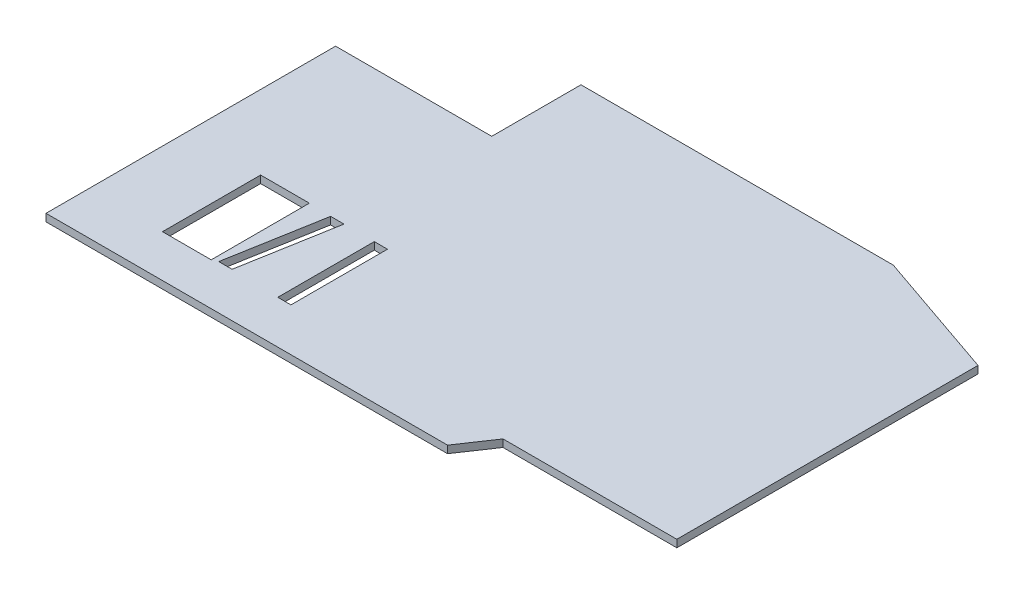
ISO-10303-21;
HEADER;
FILE_DESCRIPTION(('STEP AP214'),'2;1');
FILE_NAME('part.step','',(''),(''),'','','');
FILE_SCHEMA(('AUTOMOTIVE_DESIGN { 1 0 10303 214 1 1 1 1 }'));
ENDSEC;
DATA;
#1=APPLICATION_CONTEXT('core data for automotive mechanical design processes');
#2=APPLICATION_PROTOCOL_DEFINITION('international standard','automotive_design',2000,#1);
#3=PRODUCT_CONTEXT('',#1,'mechanical');
#4=PRODUCT('Part','Part','',(#3));
#5=PRODUCT_RELATED_PRODUCT_CATEGORY('part','',(#4));
#6=PRODUCT_DEFINITION_FORMATION('','',#4);
#7=PRODUCT_DEFINITION_CONTEXT('part definition',#1,'design');
#8=PRODUCT_DEFINITION('design','',#6,#7);
#9=PRODUCT_DEFINITION_SHAPE('','',#8);
#10=(LENGTH_UNIT() NAMED_UNIT(*) SI_UNIT(.MILLI.,.METRE.));
#11=(NAMED_UNIT(*) PLANE_ANGLE_UNIT() SI_UNIT($,.RADIAN.));
#12=(NAMED_UNIT(*) SI_UNIT($,.STERADIAN.) SOLID_ANGLE_UNIT());
#13=UNCERTAINTY_MEASURE_WITH_UNIT(LENGTH_MEASURE(1.E-05),#10,'distance_accuracy_value','');
#14=(GEOMETRIC_REPRESENTATION_CONTEXT(3) GLOBAL_UNCERTAINTY_ASSIGNED_CONTEXT((#13)) GLOBAL_UNIT_ASSIGNED_CONTEXT((#10,
#11,#12)) REPRESENTATION_CONTEXT('',''));
#15=CARTESIAN_POINT('',(0.,0.,0.));
#16=DIRECTION('',(0.,0.,1.));
#17=DIRECTION('',(1.,0.,0.));
#18=AXIS2_PLACEMENT_3D('',#15,#16,#17);
#19=CARTESIAN_POINT('',(2435.961,101.6,0.));
#20=DIRECTION('',(0.,1.,0.));
#21=DIRECTION('',(0.,0.,1.));
#22=AXIS2_PLACEMENT_3D('',#19,#20,#21);
#23=PLANE('',#22);
#24=DIRECTION('',(0.999999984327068,0.,0.000177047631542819));
#25=VECTOR('',#24,1.);
#26=CARTESIAN_POINT('',(1933.85026050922,101.6,-608.859114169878));
#27=LINE('',#26,#25);
#28=CARTESIAN_POINT('',(1751.24445826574,101.6,-608.891444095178));
#29=VERTEX_POINT('',#28);
#30=CARTESIAN_POINT('',(1933.85026050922,101.6,-608.859114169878));
#31=VERTEX_POINT('',#30);
#32=EDGE_CURVE('E56',#29,#31,#27,.T.);
#33=ORIENTED_EDGE('',*,*,#32,.F.);
#34=DIRECTION('',(-0.173810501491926,0.,0.984779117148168));
#35=VECTOR('',#34,1.);
#36=CARTESIAN_POINT('',(1751.24445826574,101.6,-608.891444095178));
#37=LINE('',#36,#35);
#38=CARTESIAN_POINT('',(1980.56363727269,101.6,-1908.17276892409));
#39=VERTEX_POINT('',#38);
#40=EDGE_CURVE('E209',#39,#29,#37,.T.);
#41=ORIENTED_EDGE('',*,*,#40,.F.);
#42=DIRECTION('',(-0.999999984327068,0.,-0.000177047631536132));
#43=VECTOR('',#42,1.);
#44=CARTESIAN_POINT('',(2163.16943951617,101.6,-1908.14043899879));
#45=LINE('',#44,#43);
#46=CARTESIAN_POINT('',(2163.16943951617,101.6,-1908.14043899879));
#47=VERTEX_POINT('',#46);
#48=EDGE_CURVE('E212',#47,#39,#45,.T.);
#49=ORIENTED_EDGE('',*,*,#48,.F.);
#50=DIRECTION('',(0.173810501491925,0.,-0.984779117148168));
#51=VECTOR('',#50,1.);
#52=CARTESIAN_POINT('',(1933.85026050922,101.6,-608.859114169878));
#53=LINE('',#52,#51);
#54=EDGE_CURVE('E219',#31,#47,#53,.T.);
#55=ORIENTED_EDGE('',*,*,#54,.F.);
#56=EDGE_LOOP('',(#33,#41,#49,#55));
#57=FACE_BOUND('',#56,.T.);
#58=DIRECTION('',(0.999999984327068,0.,0.000177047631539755));
#59=VECTOR('',#58,1.);
#60=CARTESIAN_POINT('',(2757.17381212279,101.6,-589.612691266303));
#61=LINE('',#60,#59);
#62=CARTESIAN_POINT('',(2577.34181494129,101.6,-589.644530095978));
#63=VERTEX_POINT('',#62);
#64=CARTESIAN_POINT('',(2757.17381212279,101.6,-589.612691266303));
#65=VERTEX_POINT('',#64);
#66=EDGE_CURVE('E227',#63,#65,#61,.T.);
#67=ORIENTED_EDGE('',*,*,#66,.F.);
#68=DIRECTION('',(-0.000177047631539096,0.,0.999999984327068));
#69=VECTOR('',#68,1.);
#70=CARTESIAN_POINT('',(2577.34181494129,101.6,-589.644530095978));
#71=LINE('',#70,#69);
#72=CARTESIAN_POINT('',(2577.57523853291,101.6,-1908.06706943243));
#73=VERTEX_POINT('',#72);
#74=EDGE_CURVE('E236',#73,#63,#71,.T.);
#75=ORIENTED_EDGE('',*,*,#74,.F.);
#76=DIRECTION('',(-0.999999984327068,0.,-0.000177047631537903));
#77=VECTOR('',#76,1.);
#78=CARTESIAN_POINT('',(2757.40723571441,101.6,-1908.03523060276));
#79=LINE('',#78,#77);
#80=CARTESIAN_POINT('',(2757.40723571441,101.6,-1908.03523060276));
#81=VERTEX_POINT('',#80);
#82=EDGE_CURVE('E254',#81,#73,#79,.T.);
#83=ORIENTED_EDGE('',*,*,#82,.F.);
#84=DIRECTION('',(0.000177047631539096,0.,-0.999999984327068));
#85=VECTOR('',#84,1.);
#86=CARTESIAN_POINT('',(2757.17381212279,101.6,-589.612691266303));
#87=LINE('',#86,#85);
#88=EDGE_CURVE('E250',#65,#81,#87,.T.);
#89=ORIENTED_EDGE('',*,*,#88,.F.);
#90=EDGE_LOOP('',(#67,#75,#83,#89));
#91=FACE_BOUND('',#90,.T.);
#92=DIRECTION('',(-1.,0.,0.));
#93=VECTOR('',#92,1.);
#94=CARTESIAN_POINT('',(1013.37500000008,101.6,-1919.06250000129));
#95=LINE('',#94,#93);
#96=CARTESIAN_POINT('',(1679.17500000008,101.6,-1919.06250000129));
#97=VERTEX_POINT('',#96);
#98=CARTESIAN_POINT('',(1013.37500000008,101.6,-1919.06250000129));
#99=VERTEX_POINT('',#98);
#100=EDGE_CURVE('E263',#97,#99,#95,.T.);
#101=ORIENTED_EDGE('',*,*,#100,.F.);
#102=DIRECTION('',(0.,0.,-1.));
#103=VECTOR('',#102,1.);
#104=CARTESIAN_POINT('',(1679.17500000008,101.6,-1919.06250000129));
#105=LINE('',#104,#103);
#106=CARTESIAN_POINT('',(1679.17500000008,101.6,-578.262500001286));
#107=VERTEX_POINT('',#106);
#108=EDGE_CURVE('E276',#107,#97,#105,.T.);
#109=ORIENTED_EDGE('',*,*,#108,.F.);
#110=DIRECTION('',(1.,0.,0.));
#111=VECTOR('',#110,1.);
#112=CARTESIAN_POINT('',(1013.37500000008,101.6,-578.262500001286));
#113=LINE('',#112,#111);
#114=CARTESIAN_POINT('',(1013.37500000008,101.6,-578.262500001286));
#115=VERTEX_POINT('',#114);
#116=EDGE_CURVE('E291',#115,#107,#113,.T.);
#117=ORIENTED_EDGE('',*,*,#116,.F.);
#118=DIRECTION('',(0.,0.,1.));
#119=VECTOR('',#118,1.);
#120=CARTESIAN_POINT('',(1013.37500000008,101.6,-578.262500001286));
#121=LINE('',#120,#119);
#122=EDGE_CURVE('E288',#99,#115,#121,.T.);
#123=ORIENTED_EDGE('',*,*,#122,.F.);
#124=EDGE_LOOP('',(#101,#109,#117,#123));
#125=FACE_BOUND('',#124,.T.);
#126=DIRECTION('',(0.000173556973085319,0.,-0.999999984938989));
#127=VECTOR('',#126,1.);
#128=CARTESIAN_POINT('',(0.686615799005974,101.6,-3956.14060592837));
#129=LINE('',#128,#127);
#130=CARTESIAN_POINT('',(0.,101.6,0.));
#131=VERTEX_POINT('',#130);
#132=CARTESIAN_POINT('',(0.686615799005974,101.6,-3956.14060592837));
#133=VERTEX_POINT('',#132);
#134=EDGE_CURVE('E11',#131,#133,#129,.T.);
#135=ORIENTED_EDGE('',*,*,#134,.F.);
#136=DIRECTION('',(-1.,0.,0.));
#137=VECTOR('',#136,1.);
#138=CARTESIAN_POINT('',(0.,101.6,0.));
#139=LINE('',#138,#137);
#140=CARTESIAN_POINT('',(5486.4,101.6,0.));
#141=VERTEX_POINT('',#140);
#142=EDGE_CURVE('E311',#141,#131,#139,.T.);
#143=ORIENTED_EDGE('',*,*,#142,.F.);
#144=DIRECTION('',(0.559192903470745,0.,-0.829037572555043));
#145=VECTOR('',#144,1.);
#146=CARTESIAN_POINT('',(5791.77524458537,101.6,-452.737418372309));
#147=LINE('',#146,#145);
#148=CARTESIAN_POINT('',(5791.77524458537,101.6,-452.737418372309));
#149=VERTEX_POINT('',#148);
#150=EDGE_CURVE('E345',#141,#149,#147,.T.);
#151=ORIENTED_EDGE('',*,*,#150,.T.);
#152=DIRECTION('',(1.,0.,0.));
#153=VECTOR('',#152,1.);
#154=CARTESIAN_POINT('',(8166.67524458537,101.6,-452.737418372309));
#155=LINE('',#154,#153);
#156=CARTESIAN_POINT('',(8166.67524458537,101.6,-452.737418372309));
#157=VERTEX_POINT('',#156);
#158=EDGE_CURVE('E349',#149,#157,#155,.T.);
#159=ORIENTED_EDGE('',*,*,#158,.T.);
#160=DIRECTION('',(0.,0.,1.));
#161=VECTOR('',#160,1.);
#162=CARTESIAN_POINT('',(8166.67524458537,101.6,-452.737418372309));
#163=LINE('',#162,#161);
#164=CARTESIAN_POINT('',(8166.67524458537,101.6,-4567.53741837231));
#165=VERTEX_POINT('',#164);
#166=EDGE_CURVE('E314',#165,#157,#163,.T.);
#167=ORIENTED_EDGE('',*,*,#166,.F.);
#168=DIRECTION('',(-0.945518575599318,0.,-0.325568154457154));
#169=VECTOR('',#168,1.);
#170=CARTESIAN_POINT('',(6401.48661579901,101.6,-5175.34060592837));
#171=LINE('',#170,#169);
#172=CARTESIAN_POINT('',(6401.48661579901,101.6,-5175.34060592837));
#173=VERTEX_POINT('',#172);
#174=EDGE_CURVE('E352',#165,#173,#171,.T.);
#175=ORIENTED_EDGE('',*,*,#174,.T.);
#176=DIRECTION('',(1.,0.,0.));
#177=VECTOR('',#176,1.);
#178=CARTESIAN_POINT('',(6401.48661579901,101.6,-5175.34060592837));
#179=LINE('',#178,#177);
#180=CARTESIAN_POINT('',(2134.28661579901,101.6,-5175.34060592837));
#181=VERTEX_POINT('',#180);
#182=EDGE_CURVE('E48',#181,#173,#179,.T.);
#183=ORIENTED_EDGE('',*,*,#182,.F.);
#184=DIRECTION('',(0.,0.,1.));
#185=VECTOR('',#184,1.);
#186=CARTESIAN_POINT('',(2134.28661579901,101.6,-3956.14060592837));
#187=LINE('',#186,#185);
#188=CARTESIAN_POINT('',(2134.28661579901,101.6,-3956.14060592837));
#189=VERTEX_POINT('',#188);
#190=EDGE_CURVE('E355',#181,#189,#187,.T.);
#191=ORIENTED_EDGE('',*,*,#190,.T.);
#192=DIRECTION('',(-1.,0.,0.));
#193=VECTOR('',#192,1.);
#194=CARTESIAN_POINT('',(0.686615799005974,101.6,-3956.14060592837));
#195=LINE('',#194,#193);
#196=EDGE_CURVE('E298',#189,#133,#195,.T.);
#197=ORIENTED_EDGE('',*,*,#196,.T.);
#198=EDGE_LOOP('',(#135,#143,#151,#159,#167,#175,#183,#191,#197));
#199=FACE_BOUND('',#198,.T.);
#200=ADVANCED_FACE('F38',(#57,#91,#125,#199),#23,.T.);
#201=CARTESIAN_POINT('',(5791.77524458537,3200.4,-452.737418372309));
#202=DIRECTION('',(-0.829037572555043,0.,-0.559192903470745));
#203=DIRECTION('',(-0.559192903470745,0.,0.829037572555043));
#204=AXIS2_PLACEMENT_3D('',#201,#202,#203);
#205=PLANE('',#204);
#206=ORIENTED_EDGE('',*,*,#150,.F.);
#207=DIRECTION('',(0.,-1.,0.));
#208=VECTOR('',#207,1.);
#209=CARTESIAN_POINT('',(5486.4,3200.4,0.));
#210=LINE('',#209,#208);
#211=CARTESIAN_POINT('',(5486.4,0.,0.));
#212=VERTEX_POINT('',#211);
#213=EDGE_CURVE('E348',#141,#212,#210,.T.);
#214=ORIENTED_EDGE('',*,*,#213,.T.);
#215=DIRECTION('',(-0.559192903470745,0.,0.829037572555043));
#216=VECTOR('',#215,1.);
#217=CARTESIAN_POINT('',(5486.4,0.,0.));
#218=LINE('',#217,#216);
#219=CARTESIAN_POINT('',(5791.77524458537,0.,-452.737418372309));
#220=VERTEX_POINT('',#219);
#221=EDGE_CURVE('E320',#220,#212,#218,.T.);
#222=ORIENTED_EDGE('',*,*,#221,.F.);
#223=DIRECTION('',(0.,-1.,0.));
#224=VECTOR('',#223,1.);
#225=CARTESIAN_POINT('',(5791.77524458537,3200.4,-452.737418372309));
#226=LINE('',#225,#224);
#227=EDGE_CURVE('E361',#149,#220,#226,.T.);
#228=ORIENTED_EDGE('',*,*,#227,.F.);
#229=EDGE_LOOP('',(#206,#214,#222,#228));
#230=FACE_BOUND('',#229,.T.);
#231=ADVANCED_FACE('F382',(#230),#205,.F.);
#232=CARTESIAN_POINT('',(2134.28661579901,3200.4,-3956.14060592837));
#233=DIRECTION('',(1.,0.,0.));
#234=DIRECTION('',(0.,0.,-1.));
#235=AXIS2_PLACEMENT_3D('',#232,#233,#234);
#236=PLANE('',#235);
#237=ORIENTED_EDGE('',*,*,#190,.F.);
#238=DIRECTION('',(0.,-1.,0.));
#239=VECTOR('',#238,1.);
#240=CARTESIAN_POINT('',(2134.28661579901,3200.4,-5175.34060592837));
#241=LINE('',#240,#239);
#242=CARTESIAN_POINT('',(2134.28661579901,0.,-5175.34060592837));
#243=VERTEX_POINT('',#242);
#244=EDGE_CURVE('E368',#181,#243,#241,.T.);
#245=ORIENTED_EDGE('',*,*,#244,.T.);
#246=DIRECTION('',(0.,0.,-1.));
#247=VECTOR('',#246,1.);
#248=CARTESIAN_POINT('',(2134.28661579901,0.,-5175.34060592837));
#249=LINE('',#248,#247);
#250=CARTESIAN_POINT('',(2134.28661579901,0.,-3956.14060592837));
#251=VERTEX_POINT('',#250);
#252=EDGE_CURVE('E336',#251,#243,#249,.T.);
#253=ORIENTED_EDGE('',*,*,#252,.F.);
#254=DIRECTION('',(0.,-1.,0.));
#255=VECTOR('',#254,1.);
#256=CARTESIAN_POINT('',(2134.28661579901,3200.4,-3956.14060592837));
#257=LINE('',#256,#255);
#258=EDGE_CURVE('E42',#189,#251,#257,.T.);
#259=ORIENTED_EDGE('',*,*,#258,.F.);
#260=EDGE_LOOP('',(#237,#245,#253,#259));
#261=FACE_BOUND('',#260,.T.);
#262=ADVANCED_FACE('F379',(#261),#236,.F.);
#263=CARTESIAN_POINT('',(0.,3098.8,0.));
#264=DIRECTION('',(0.,0.,-1.));
#265=DIRECTION('',(-1.,0.,0.));
#266=AXIS2_PLACEMENT_3D('',#263,#264,#265);
#267=PLANE('',#266);
#268=ORIENTED_EDGE('',*,*,#142,.T.);
#269=DIRECTION('',(0.,1.,0.));
#270=VECTOR('',#269,1.);
#271=CARTESIAN_POINT('',(0.,0.,0.));
#272=LINE('',#271,#270);
#273=CARTESIAN_POINT('',(0.,0.,0.));
#274=VERTEX_POINT('',#273);
#275=EDGE_CURVE('E307',#274,#131,#272,.T.);
#276=ORIENTED_EDGE('',*,*,#275,.F.);
#277=DIRECTION('',(-1.,0.,0.));
#278=VECTOR('',#277,1.);
#279=CARTESIAN_POINT('',(0.,0.,0.));
#280=LINE('',#279,#278);
#281=EDGE_CURVE('E310',#212,#274,#280,.T.);
#282=ORIENTED_EDGE('',*,*,#281,.F.);
#283=ORIENTED_EDGE('',*,*,#213,.F.);
#284=EDGE_LOOP('',(#268,#276,#282,#283));
#285=FACE_BOUND('',#284,.T.);
#286=ADVANCED_FACE('F381',(#285),#267,.F.);
#287=CARTESIAN_POINT('',(0.,0.,0.));
#288=DIRECTION('',(0.,1.,0.));
#289=DIRECTION('',(0.,0.,1.));
#290=AXIS2_PLACEMENT_3D('',#287,#288,#289);
#291=PLANE('',#290);
#292=DIRECTION('',(-0.173810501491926,0.,0.984779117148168));
#293=VECTOR('',#292,1.);
#294=CARTESIAN_POINT('',(1751.24445826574,0.,-608.891444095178));
#295=LINE('',#294,#293);
#296=CARTESIAN_POINT('',(1980.56363727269,0.,-1908.17276892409));
#297=VERTEX_POINT('',#296);
#298=CARTESIAN_POINT('',(1751.24445826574,0.,-608.891444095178));
#299=VERTEX_POINT('',#298);
#300=EDGE_CURVE('E198',#297,#299,#295,.T.);
#301=ORIENTED_EDGE('',*,*,#300,.T.);
#302=DIRECTION('',(0.999999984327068,0.,0.000177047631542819));
#303=VECTOR('',#302,1.);
#304=CARTESIAN_POINT('',(1933.85026050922,0.,-608.859114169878));
#305=LINE('',#304,#303);
#306=CARTESIAN_POINT('',(1933.85026050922,0.,-608.859114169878));
#307=VERTEX_POINT('',#306);
#308=EDGE_CURVE('E192',#299,#307,#305,.T.);
#309=ORIENTED_EDGE('',*,*,#308,.T.);
#310=DIRECTION('',(0.173810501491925,0.,-0.984779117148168));
#311=VECTOR('',#310,1.);
#312=CARTESIAN_POINT('',(1933.85026050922,0.,-608.859114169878));
#313=LINE('',#312,#311);
#314=CARTESIAN_POINT('',(2163.16943951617,0.,-1908.14043899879));
#315=VERTEX_POINT('',#314);
#316=EDGE_CURVE('E201',#307,#315,#313,.T.);
#317=ORIENTED_EDGE('',*,*,#316,.T.);
#318=DIRECTION('',(-0.999999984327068,0.,-0.000177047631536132));
#319=VECTOR('',#318,1.);
#320=CARTESIAN_POINT('',(2163.16943951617,0.,-1908.14043899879));
#321=LINE('',#320,#319);
#322=EDGE_CURVE('E66',#315,#297,#321,.T.);
#323=ORIENTED_EDGE('',*,*,#322,.T.);
#324=EDGE_LOOP('',(#301,#309,#317,#323));
#325=FACE_BOUND('',#324,.T.);
#326=DIRECTION('',(-0.000177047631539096,0.,0.999999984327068));
#327=VECTOR('',#326,1.);
#328=CARTESIAN_POINT('',(2577.34181494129,0.,-589.644530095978));
#329=LINE('',#328,#327);
#330=CARTESIAN_POINT('',(2577.57523853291,0.,-1908.06706943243));
#331=VERTEX_POINT('',#330);
#332=CARTESIAN_POINT('',(2577.34181494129,0.,-589.644530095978));
#333=VERTEX_POINT('',#332);
#334=EDGE_CURVE('E244',#331,#333,#329,.T.);
#335=ORIENTED_EDGE('',*,*,#334,.T.);
#336=DIRECTION('',(0.999999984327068,0.,0.000177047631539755));
#337=VECTOR('',#336,1.);
#338=CARTESIAN_POINT('',(2757.17381212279,0.,-589.612691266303));
#339=LINE('',#338,#337);
#340=CARTESIAN_POINT('',(2757.17381212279,0.,-589.612691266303));
#341=VERTEX_POINT('',#340);
#342=EDGE_CURVE('E232',#333,#341,#339,.T.);
#343=ORIENTED_EDGE('',*,*,#342,.T.);
#344=DIRECTION('',(0.000177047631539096,0.,-0.999999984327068));
#345=VECTOR('',#344,1.);
#346=CARTESIAN_POINT('',(2757.17381212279,0.,-589.612691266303));
#347=LINE('',#346,#345);
#348=CARTESIAN_POINT('',(2757.40723571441,0.,-1908.03523060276));
#349=VERTEX_POINT('',#348);
#350=EDGE_CURVE('E235',#341,#349,#347,.T.);
#351=ORIENTED_EDGE('',*,*,#350,.T.);
#352=DIRECTION('',(-0.999999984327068,0.,-0.000177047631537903));
#353=VECTOR('',#352,1.);
#354=CARTESIAN_POINT('',(2757.40723571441,0.,-1908.03523060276));
#355=LINE('',#354,#353);
#356=EDGE_CURVE('E240',#349,#331,#355,.T.);
#357=ORIENTED_EDGE('',*,*,#356,.T.);
#358=EDGE_LOOP('',(#335,#343,#351,#357));
#359=FACE_BOUND('',#358,.T.);
#360=DIRECTION('',(0.,0.,-1.));
#361=VECTOR('',#360,1.);
#362=CARTESIAN_POINT('',(1679.17500000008,0.,-1919.06250000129));
#363=LINE('',#362,#361);
#364=CARTESIAN_POINT('',(1679.17500000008,0.,-578.262500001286));
#365=VERTEX_POINT('',#364);
#366=CARTESIAN_POINT('',(1679.17500000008,0.,-1919.06250000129));
#367=VERTEX_POINT('',#366);
#368=EDGE_CURVE('E283',#365,#367,#363,.T.);
#369=ORIENTED_EDGE('',*,*,#368,.T.);
#370=DIRECTION('',(-1.,0.,0.));
#371=VECTOR('',#370,1.);
#372=CARTESIAN_POINT('',(1013.37500000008,0.,-1919.06250000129));
#373=LINE('',#372,#371);
#374=CARTESIAN_POINT('',(1013.37500000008,0.,-1919.06250000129));
#375=VERTEX_POINT('',#374);
#376=EDGE_CURVE('E272',#367,#375,#373,.T.);
#377=ORIENTED_EDGE('',*,*,#376,.T.);
#378=DIRECTION('',(0.,0.,1.));
#379=VECTOR('',#378,1.);
#380=CARTESIAN_POINT('',(1013.37500000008,0.,-578.262500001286));
#381=LINE('',#380,#379);
#382=CARTESIAN_POINT('',(1013.37500000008,0.,-578.262500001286));
#383=VERTEX_POINT('',#382);
#384=EDGE_CURVE('E275',#375,#383,#381,.T.);
#385=ORIENTED_EDGE('',*,*,#384,.T.);
#386=DIRECTION('',(1.,0.,0.));
#387=VECTOR('',#386,1.);
#388=CARTESIAN_POINT('',(1013.37500000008,0.,-578.262500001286));
#389=LINE('',#388,#387);
#390=EDGE_CURVE('E280',#383,#365,#389,.T.);
#391=ORIENTED_EDGE('',*,*,#390,.T.);
#392=EDGE_LOOP('',(#369,#377,#385,#391));
#393=FACE_BOUND('',#392,.T.);
#394=DIRECTION('',(0.000173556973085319,0.,-0.999999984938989));
#395=VECTOR('',#394,1.);
#396=CARTESIAN_POINT('',(0.686615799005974,0.,-3956.14060592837));
#397=LINE('',#396,#395);
#398=CARTESIAN_POINT('',(0.686615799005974,0.,-3956.14060592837));
#399=VERTEX_POINT('',#398);
#400=EDGE_CURVE('E315',#274,#399,#397,.T.);
#401=ORIENTED_EDGE('',*,*,#400,.T.);
#402=DIRECTION('',(1.,0.,0.));
#403=VECTOR('',#402,1.);
#404=CARTESIAN_POINT('',(2134.28661579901,0.,-3956.14060592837));
#405=LINE('',#404,#403);
#406=EDGE_CURVE('E339',#399,#251,#405,.T.);
#407=ORIENTED_EDGE('',*,*,#406,.T.);
#408=ORIENTED_EDGE('',*,*,#252,.T.);
#409=DIRECTION('',(1.,0.,0.));
#410=VECTOR('',#409,1.);
#411=CARTESIAN_POINT('',(6401.48661579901,0.,-5175.34060592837));
#412=LINE('',#411,#410);
#413=CARTESIAN_POINT('',(6401.48661579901,0.,-5175.34060592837));
#414=VERTEX_POINT('',#413);
#415=EDGE_CURVE('E333',#243,#414,#412,.T.);
#416=ORIENTED_EDGE('',*,*,#415,.T.);
#417=DIRECTION('',(0.945518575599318,0.,0.325568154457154));
#418=VECTOR('',#417,1.);
#419=CARTESIAN_POINT('',(8166.67524458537,0.,-4567.53741837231));
#420=LINE('',#419,#418);
#421=CARTESIAN_POINT('',(8166.67524458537,0.,-4567.53741837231));
#422=VERTEX_POINT('',#421);
#423=EDGE_CURVE('E330',#414,#422,#420,.T.);
#424=ORIENTED_EDGE('',*,*,#423,.T.);
#425=DIRECTION('',(0.,0.,1.));
#426=VECTOR('',#425,1.);
#427=CARTESIAN_POINT('',(8166.67524458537,0.,-452.737418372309));
#428=LINE('',#427,#426);
#429=CARTESIAN_POINT('',(8166.67524458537,0.,-452.737418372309));
#430=VERTEX_POINT('',#429);
#431=EDGE_CURVE('E326',#422,#430,#428,.T.);
#432=ORIENTED_EDGE('',*,*,#431,.T.);
#433=DIRECTION('',(-1.,0.,0.));
#434=VECTOR('',#433,1.);
#435=CARTESIAN_POINT('',(5791.77524458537,0.,-452.737418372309));
#436=LINE('',#435,#434);
#437=EDGE_CURVE('E323',#430,#220,#436,.T.);
#438=ORIENTED_EDGE('',*,*,#437,.T.);
#439=ORIENTED_EDGE('',*,*,#221,.T.);
#440=ORIENTED_EDGE('',*,*,#281,.T.);
#441=EDGE_LOOP('',(#401,#407,#408,#416,#424,#432,#438,#439,#440));
#442=FACE_BOUND('',#441,.T.);
#443=ADVANCED_FACE('F206',(#325,#359,#393,#442),#291,.F.);
#444=CARTESIAN_POINT('',(0.686615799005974,3200.4,-3956.14060592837));
#445=DIRECTION('',(0.,0.,1.));
#446=DIRECTION('',(1.,0.,0.));
#447=AXIS2_PLACEMENT_3D('',#444,#445,#446);
#448=PLANE('',#447);
#449=ORIENTED_EDGE('',*,*,#196,.F.);
#450=ORIENTED_EDGE('',*,*,#258,.T.);
#451=ORIENTED_EDGE('',*,*,#406,.F.);
#452=DIRECTION('',(0.,1.,0.));
#453=VECTOR('',#452,1.);
#454=CARTESIAN_POINT('',(0.686615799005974,0.,-3956.14060592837));
#455=LINE('',#454,#453);
#456=EDGE_CURVE('E305',#399,#133,#455,.T.);
#457=ORIENTED_EDGE('',*,*,#456,.T.);
#458=EDGE_LOOP('',(#449,#450,#451,#457));
#459=FACE_BOUND('',#458,.T.);
#460=ADVANCED_FACE('F40',(#459),#448,.F.);
#461=CARTESIAN_POINT('',(0.686615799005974,0.,-3956.14060592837));
#462=DIRECTION('',(0.999999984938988,0.,0.000173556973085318));
#463=DIRECTION('',(0.000173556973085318,0.,-0.999999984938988));
#464=AXIS2_PLACEMENT_3D('',#461,#462,#463);
#465=PLANE('',#464);
#466=ORIENTED_EDGE('',*,*,#275,.T.);
#467=ORIENTED_EDGE('',*,*,#134,.T.);
#468=ORIENTED_EDGE('',*,*,#456,.F.);
#469=ORIENTED_EDGE('',*,*,#400,.F.);
#470=EDGE_LOOP('',(#466,#467,#468,#469));
#471=FACE_BOUND('',#470,.T.);
#472=ADVANCED_FACE('F400',(#471),#465,.F.);
#473=CARTESIAN_POINT('',(6401.48661579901,3200.4,-5175.34060592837));
#474=DIRECTION('',(-0.325568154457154,0.,0.945518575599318));
#475=DIRECTION('',(0.945518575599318,0.,0.325568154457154));
#476=AXIS2_PLACEMENT_3D('',#473,#474,#475);
#477=PLANE('',#476);
#478=ORIENTED_EDGE('',*,*,#174,.F.);
#479=DIRECTION('',(0.,-1.,0.));
#480=VECTOR('',#479,1.);
#481=CARTESIAN_POINT('',(8166.67524458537,3200.4,-4567.53741837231));
#482=LINE('',#481,#480);
#483=EDGE_CURVE('E365',#165,#422,#482,.T.);
#484=ORIENTED_EDGE('',*,*,#483,.T.);
#485=ORIENTED_EDGE('',*,*,#423,.F.);
#486=DIRECTION('',(0.,-1.,0.));
#487=VECTOR('',#486,1.);
#488=CARTESIAN_POINT('',(6401.48661579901,3200.4,-5175.34060592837));
#489=LINE('',#488,#487);
#490=EDGE_CURVE('E367',#173,#414,#489,.T.);
#491=ORIENTED_EDGE('',*,*,#490,.F.);
#492=EDGE_LOOP('',(#478,#484,#485,#491));
#493=FACE_BOUND('',#492,.T.);
#494=ADVANCED_FACE('F396',(#493),#477,.F.);
#495=CARTESIAN_POINT('',(2134.28661579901,3200.4,-5175.34060592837));
#496=DIRECTION('',(0.,0.,1.));
#497=DIRECTION('',(1.,0.,0.));
#498=AXIS2_PLACEMENT_3D('',#495,#496,#497);
#499=PLANE('',#498);
#500=ORIENTED_EDGE('',*,*,#182,.T.);
#501=ORIENTED_EDGE('',*,*,#490,.T.);
#502=ORIENTED_EDGE('',*,*,#415,.F.);
#503=ORIENTED_EDGE('',*,*,#244,.F.);
#504=EDGE_LOOP('',(#500,#501,#502,#503));
#505=FACE_BOUND('',#504,.T.);
#506=ADVANCED_FACE('F392',(#505),#499,.F.);
#507=CARTESIAN_POINT('',(8166.67524458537,3200.4,-452.737418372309));
#508=DIRECTION('',(0.,0.,-1.));
#509=DIRECTION('',(-1.,0.,0.));
#510=AXIS2_PLACEMENT_3D('',#507,#508,#509);
#511=PLANE('',#510);
#512=ORIENTED_EDGE('',*,*,#158,.F.);
#513=ORIENTED_EDGE('',*,*,#227,.T.);
#514=ORIENTED_EDGE('',*,*,#437,.F.);
#515=DIRECTION('',(0.,-1.,0.));
#516=VECTOR('',#515,1.);
#517=CARTESIAN_POINT('',(8166.67524458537,3200.4,-452.737418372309));
#518=LINE('',#517,#516);
#519=EDGE_CURVE('E363',#157,#430,#518,.T.);
#520=ORIENTED_EDGE('',*,*,#519,.F.);
#521=EDGE_LOOP('',(#512,#513,#514,#520));
#522=FACE_BOUND('',#521,.T.);
#523=ADVANCED_FACE('F395',(#522),#511,.F.);
#524=CARTESIAN_POINT('',(8166.67524458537,3200.4,-4567.53741837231));
#525=DIRECTION('',(-1.,0.,0.));
#526=DIRECTION('',(0.,0.,1.));
#527=AXIS2_PLACEMENT_3D('',#524,#525,#526);
#528=PLANE('',#527);
#529=ORIENTED_EDGE('',*,*,#166,.T.);
#530=ORIENTED_EDGE('',*,*,#519,.T.);
#531=ORIENTED_EDGE('',*,*,#431,.F.);
#532=ORIENTED_EDGE('',*,*,#483,.F.);
#533=EDGE_LOOP('',(#529,#530,#531,#532));
#534=FACE_BOUND('',#533,.T.);
#535=ADVANCED_FACE('F402',(#534),#528,.F.);
#536=CARTESIAN_POINT('',(1013.37500000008,0.,-1919.06250000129));
#537=DIRECTION('',(0.,0.,-1.));
#538=DIRECTION('',(-1.,0.,0.));
#539=AXIS2_PLACEMENT_3D('',#536,#537,#538);
#540=PLANE('',#539);
#541=ORIENTED_EDGE('',*,*,#100,.T.);
#542=DIRECTION('',(0.,1.,0.));
#543=VECTOR('',#542,1.);
#544=CARTESIAN_POINT('',(1013.37500000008,0.,-1919.06250000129));
#545=LINE('',#544,#543);
#546=EDGE_CURVE('E286',#375,#99,#545,.T.);
#547=ORIENTED_EDGE('',*,*,#546,.F.);
#548=ORIENTED_EDGE('',*,*,#376,.F.);
#549=DIRECTION('',(0.,1.,0.));
#550=VECTOR('',#549,1.);
#551=CARTESIAN_POINT('',(1679.17500000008,0.,-1919.06250000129));
#552=LINE('',#551,#550);
#553=EDGE_CURVE('E296',#367,#97,#552,.T.);
#554=ORIENTED_EDGE('',*,*,#553,.T.);
#555=EDGE_LOOP('',(#541,#547,#548,#554));
#556=FACE_BOUND('',#555,.T.);
#557=ADVANCED_FACE('F405',(#556),#540,.F.);
#558=CARTESIAN_POINT('',(1679.17500000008,0.,-1919.06250000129));
#559=DIRECTION('',(1.,0.,0.));
#560=DIRECTION('',(0.,0.,-1.));
#561=AXIS2_PLACEMENT_3D('',#558,#559,#560);
#562=PLANE('',#561);
#563=ORIENTED_EDGE('',*,*,#108,.T.);
#564=ORIENTED_EDGE('',*,*,#553,.F.);
#565=ORIENTED_EDGE('',*,*,#368,.F.);
#566=DIRECTION('',(0.,1.,0.));
#567=VECTOR('',#566,1.);
#568=CARTESIAN_POINT('',(1679.17500000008,0.,-578.262500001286));
#569=LINE('',#568,#567);
#570=EDGE_CURVE('E299',#365,#107,#569,.T.);
#571=ORIENTED_EDGE('',*,*,#570,.T.);
#572=EDGE_LOOP('',(#563,#564,#565,#571));
#573=FACE_BOUND('',#572,.T.);
#574=ADVANCED_FACE('F420',(#573),#562,.F.);
#575=CARTESIAN_POINT('',(1013.37500000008,0.,-578.262500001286));
#576=DIRECTION('',(0.,0.,1.));
#577=DIRECTION('',(1.,0.,0.));
#578=AXIS2_PLACEMENT_3D('',#575,#576,#577);
#579=PLANE('',#578);
#580=ORIENTED_EDGE('',*,*,#116,.T.);
#581=ORIENTED_EDGE('',*,*,#570,.F.);
#582=ORIENTED_EDGE('',*,*,#390,.F.);
#583=DIRECTION('',(0.,1.,0.));
#584=VECTOR('',#583,1.);
#585=CARTESIAN_POINT('',(1013.37500000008,0.,-578.262500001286));
#586=LINE('',#585,#584);
#587=EDGE_CURVE('E301',#383,#115,#586,.T.);
#588=ORIENTED_EDGE('',*,*,#587,.T.);
#589=EDGE_LOOP('',(#580,#581,#582,#588));
#590=FACE_BOUND('',#589,.T.);
#591=ADVANCED_FACE('F426',(#590),#579,.F.);
#592=CARTESIAN_POINT('',(1013.37500000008,0.,-578.262500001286));
#593=DIRECTION('',(-1.,0.,0.));
#594=DIRECTION('',(0.,0.,1.));
#595=AXIS2_PLACEMENT_3D('',#592,#593,#594);
#596=PLANE('',#595);
#597=ORIENTED_EDGE('',*,*,#122,.T.);
#598=ORIENTED_EDGE('',*,*,#587,.F.);
#599=ORIENTED_EDGE('',*,*,#384,.F.);
#600=ORIENTED_EDGE('',*,*,#546,.T.);
#601=EDGE_LOOP('',(#597,#598,#599,#600));
#602=FACE_BOUND('',#601,.T.);
#603=ADVANCED_FACE('F422',(#602),#596,.F.);
#604=CARTESIAN_POINT('',(2757.17381212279,0.,-589.612691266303));
#605=DIRECTION('',(-0.000177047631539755,0.,0.999999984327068));
#606=DIRECTION('',(0.999999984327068,0.,0.000177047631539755));
#607=AXIS2_PLACEMENT_3D('',#604,#605,#606);
#608=PLANE('',#607);
#609=ORIENTED_EDGE('',*,*,#66,.T.);
#610=DIRECTION('',(0.,1.,0.));
#611=VECTOR('',#610,1.);
#612=CARTESIAN_POINT('',(2757.17381212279,0.,-589.612691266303));
#613=LINE('',#612,#611);
#614=EDGE_CURVE('E248',#341,#65,#613,.T.);
#615=ORIENTED_EDGE('',*,*,#614,.F.);
#616=ORIENTED_EDGE('',*,*,#342,.F.);
#617=DIRECTION('',(0.,1.,0.));
#618=VECTOR('',#617,1.);
#619=CARTESIAN_POINT('',(2577.34181494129,0.,-589.644530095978));
#620=LINE('',#619,#618);
#621=EDGE_CURVE('E261',#333,#63,#620,.T.);
#622=ORIENTED_EDGE('',*,*,#621,.T.);
#623=EDGE_LOOP('',(#609,#615,#616,#622));
#624=FACE_BOUND('',#623,.T.);
#625=ADVANCED_FACE('F425',(#624),#608,.F.);
#626=CARTESIAN_POINT('',(2577.34181494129,0.,-589.644530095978));
#627=DIRECTION('',(-0.999999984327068,0.,-0.000177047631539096));
#628=DIRECTION('',(-0.000177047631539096,0.,0.999999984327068));
#629=AXIS2_PLACEMENT_3D('',#626,#627,#628);
#630=PLANE('',#629);
#631=ORIENTED_EDGE('',*,*,#74,.T.);
#632=ORIENTED_EDGE('',*,*,#621,.F.);
#633=ORIENTED_EDGE('',*,*,#334,.F.);
#634=DIRECTION('',(0.,1.,0.));
#635=VECTOR('',#634,1.);
#636=CARTESIAN_POINT('',(2577.57523853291,0.,-1908.06706943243));
#637=LINE('',#636,#635);
#638=EDGE_CURVE('E264',#331,#73,#637,.T.);
#639=ORIENTED_EDGE('',*,*,#638,.T.);
#640=EDGE_LOOP('',(#631,#632,#633,#639));
#641=FACE_BOUND('',#640,.T.);
#642=ADVANCED_FACE('F436',(#641),#630,.F.);
#643=CARTESIAN_POINT('',(2757.40723571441,0.,-1908.03523060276));
#644=DIRECTION('',(0.000177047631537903,0.,-0.999999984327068));
#645=DIRECTION('',(-0.999999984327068,0.,-0.000177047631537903));
#646=AXIS2_PLACEMENT_3D('',#643,#644,#645);
#647=PLANE('',#646);
#648=ORIENTED_EDGE('',*,*,#82,.T.);
#649=ORIENTED_EDGE('',*,*,#638,.F.);
#650=ORIENTED_EDGE('',*,*,#356,.F.);
#651=DIRECTION('',(0.,1.,0.));
#652=VECTOR('',#651,1.);
#653=CARTESIAN_POINT('',(2757.40723571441,0.,-1908.03523060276));
#654=LINE('',#653,#652);
#655=EDGE_CURVE('E267',#349,#81,#654,.T.);
#656=ORIENTED_EDGE('',*,*,#655,.T.);
#657=EDGE_LOOP('',(#648,#649,#650,#656));
#658=FACE_BOUND('',#657,.T.);
#659=ADVANCED_FACE('F441',(#658),#647,.F.);
#660=CARTESIAN_POINT('',(2757.17381212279,0.,-589.612691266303));
#661=DIRECTION('',(0.999999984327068,0.,0.000177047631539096));
#662=DIRECTION('',(0.000177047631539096,0.,-0.999999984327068));
#663=AXIS2_PLACEMENT_3D('',#660,#661,#662);
#664=PLANE('',#663);
#665=ORIENTED_EDGE('',*,*,#88,.T.);
#666=ORIENTED_EDGE('',*,*,#655,.F.);
#667=ORIENTED_EDGE('',*,*,#350,.F.);
#668=ORIENTED_EDGE('',*,*,#614,.T.);
#669=EDGE_LOOP('',(#665,#666,#667,#668));
#670=FACE_BOUND('',#669,.T.);
#671=ADVANCED_FACE('F438',(#670),#664,.F.);
#672=CARTESIAN_POINT('',(1933.85026050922,0.,-608.859114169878));
#673=DIRECTION('',(-0.000177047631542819,0.,0.999999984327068));
#674=DIRECTION('',(0.999999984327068,0.,0.000177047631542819));
#675=AXIS2_PLACEMENT_3D('',#672,#673,#674);
#676=PLANE('',#675);
#677=ORIENTED_EDGE('',*,*,#32,.T.);
#678=DIRECTION('',(0.,1.,0.));
#679=VECTOR('',#678,1.);
#680=CARTESIAN_POINT('',(1933.85026050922,0.,-608.859114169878));
#681=LINE('',#680,#679);
#682=EDGE_CURVE('E188',#307,#31,#681,.T.);
#683=ORIENTED_EDGE('',*,*,#682,.F.);
#684=ORIENTED_EDGE('',*,*,#308,.F.);
#685=DIRECTION('',(0.,1.,0.));
#686=VECTOR('',#685,1.);
#687=CARTESIAN_POINT('',(1751.24445826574,0.,-608.891444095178));
#688=LINE('',#687,#686);
#689=EDGE_CURVE('E225',#299,#29,#688,.T.);
#690=ORIENTED_EDGE('',*,*,#689,.T.);
#691=EDGE_LOOP('',(#677,#683,#684,#690));
#692=FACE_BOUND('',#691,.T.);
#693=ADVANCED_FACE('F190',(#692),#676,.F.);
#694=CARTESIAN_POINT('',(1751.24445826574,0.,-608.891444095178));
#695=DIRECTION('',(-0.984779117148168,0.,-0.173810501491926));
#696=DIRECTION('',(-0.173810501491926,0.,0.984779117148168));
#697=AXIS2_PLACEMENT_3D('',#694,#695,#696);
#698=PLANE('',#697);
#699=ORIENTED_EDGE('',*,*,#40,.T.);
#700=ORIENTED_EDGE('',*,*,#689,.F.);
#701=ORIENTED_EDGE('',*,*,#300,.F.);
#702=DIRECTION('',(0.,1.,0.));
#703=VECTOR('',#702,1.);
#704=CARTESIAN_POINT('',(1980.56363727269,0.,-1908.17276892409));
#705=LINE('',#704,#703);
#706=EDGE_CURVE('E228',#297,#39,#705,.T.);
#707=ORIENTED_EDGE('',*,*,#706,.T.);
#708=EDGE_LOOP('',(#699,#700,#701,#707));
#709=FACE_BOUND('',#708,.T.);
#710=ADVANCED_FACE('F451',(#709),#698,.F.);
#711=CARTESIAN_POINT('',(2163.16943951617,0.,-1908.14043899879));
#712=DIRECTION('',(0.000177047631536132,0.,-0.999999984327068));
#713=DIRECTION('',(-0.999999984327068,0.,-0.000177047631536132));
#714=AXIS2_PLACEMENT_3D('',#711,#712,#713);
#715=PLANE('',#714);
#716=ORIENTED_EDGE('',*,*,#48,.T.);
#717=ORIENTED_EDGE('',*,*,#706,.F.);
#718=ORIENTED_EDGE('',*,*,#322,.F.);
#719=DIRECTION('',(0.,1.,0.));
#720=VECTOR('',#719,1.);
#721=CARTESIAN_POINT('',(2163.16943951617,0.,-1908.14043899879));
#722=LINE('',#721,#720);
#723=EDGE_CURVE('E197',#315,#47,#722,.T.);
#724=ORIENTED_EDGE('',*,*,#723,.T.);
#725=EDGE_LOOP('',(#716,#717,#718,#724));
#726=FACE_BOUND('',#725,.T.);
#727=ADVANCED_FACE('F454',(#726),#715,.F.);
#728=CARTESIAN_POINT('',(1933.85026050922,0.,-608.859114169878));
#729=DIRECTION('',(0.984779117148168,0.,0.173810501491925));
#730=DIRECTION('',(0.173810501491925,0.,-0.984779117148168));
#731=AXIS2_PLACEMENT_3D('',#728,#729,#730);
#732=PLANE('',#731);
#733=ORIENTED_EDGE('',*,*,#54,.T.);
#734=ORIENTED_EDGE('',*,*,#723,.F.);
#735=ORIENTED_EDGE('',*,*,#316,.F.);
#736=ORIENTED_EDGE('',*,*,#682,.T.);
#737=EDGE_LOOP('',(#733,#734,#735,#736));
#738=FACE_BOUND('',#737,.T.);
#739=ADVANCED_FACE('F202',(#738),#732,.F.);
#740=CLOSED_SHELL('',(#200,#231,#262,#286,#443,#460,#472,#494,#506,#523,#535,#557,#574,#591,
#603,#625,#642,#659,#671,#693,#710,#727,#739));
#741=MANIFOLD_SOLID_BREP('B2',#740);
#742=ADVANCED_BREP_SHAPE_REPRESENTATION('',(#18,#741),#14);
#743=SHAPE_DEFINITION_REPRESENTATION(#9,#742);
ENDSEC;
END-ISO-10303-21;
